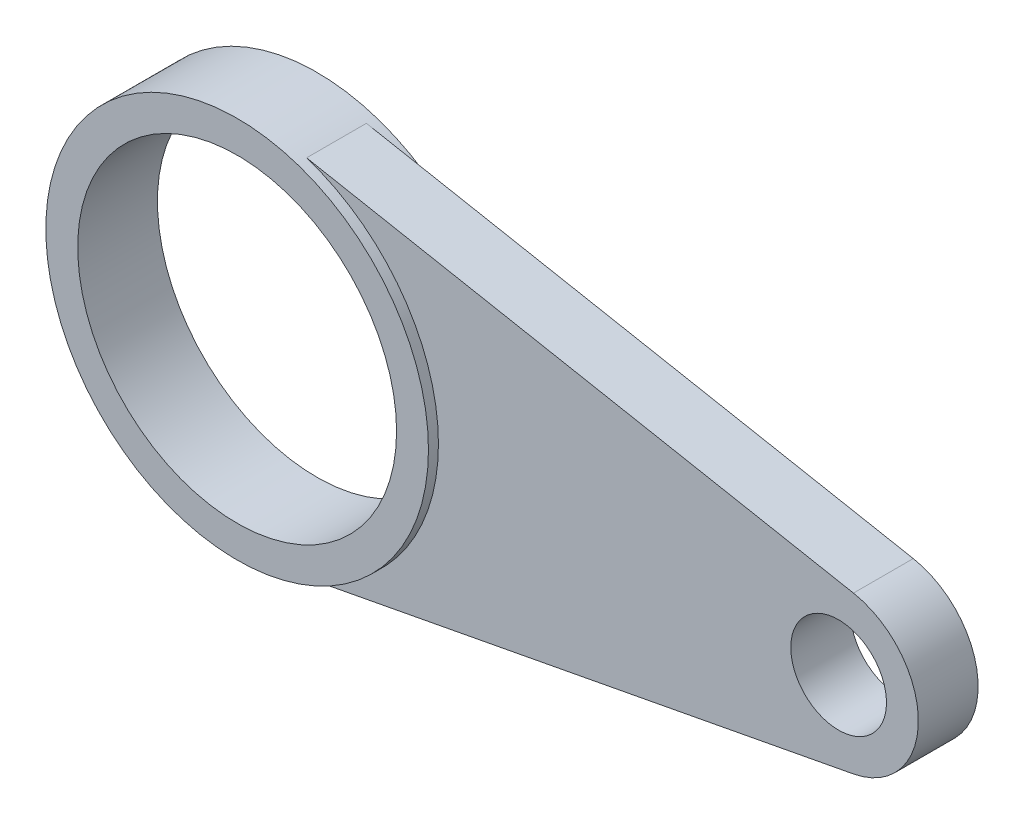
from build123d import *

# Parameters (mm, degrees)
SKETCH1_R           = 30.48
SKETCH1_R_2         = 25.4
BOSS_EXTRUDE1_DEPTH = 6.35
SKETCH2_R           = 7.62
BOSS_EXTRUDE2_DEPTH = 4.7625


with BuildPart() as part:
    # Sketch1 → Boss-Extrude1 (new, symmetric)
    with BuildSketch(Plane.XY):
        Circle(SKETCH1_R)
        Circle(SKETCH1_R_2, mode=Mode.SUBTRACT)
    extrude(amount=BOSS_EXTRUDE1_DEPTH, both=True)

    # Sketch2 → Boss-Extrude2 (add, symmetric)
    with BuildSketch(Plane.XY):
        with BuildLine():
            Line((96.595994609, 12.478420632), (5.62154717, 29.698641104))
            ThreePointArc((5.62154717, 29.698641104), (30.226, 0), (5.62154717, -29.698641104))
            Line((5.62154717, -29.698641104), (96.595994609, -12.478420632))
            ThreePointArc((96.595994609, -12.478420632), (106.934, 0), (96.595994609, 12.478420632))
        make_face()
        with Locations(Location((94.234, 0, 0), (0, 0, 180))):
            Circle(SKETCH2_R, mode=Mode.SUBTRACT)
    extrude(amount=BOSS_EXTRUDE2_DEPTH, both=True)


solid = part.part
